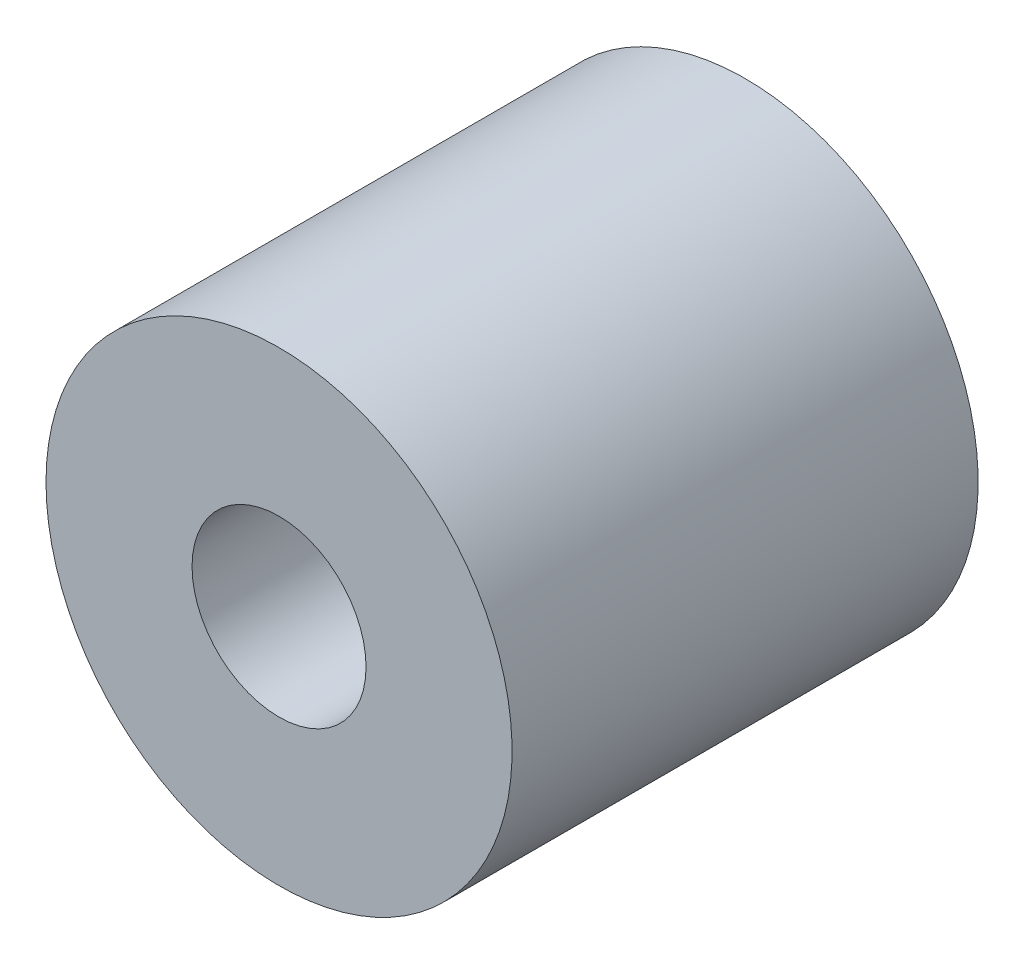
ISO-10303-21;
HEADER;
FILE_DESCRIPTION(('STEP AP214'),'2;1');
FILE_NAME('part.step','',(''),(''),'','','');
FILE_SCHEMA(('AUTOMOTIVE_DESIGN { 1 0 10303 214 1 1 1 1 }'));
ENDSEC;
DATA;
#1=APPLICATION_CONTEXT('core data for automotive mechanical design processes');
#2=APPLICATION_PROTOCOL_DEFINITION('international standard','automotive_design',2000,#1);
#3=PRODUCT_CONTEXT('',#1,'mechanical');
#4=PRODUCT('Part','Part','',(#3));
#5=PRODUCT_RELATED_PRODUCT_CATEGORY('part','',(#4));
#6=PRODUCT_DEFINITION_FORMATION('','',#4);
#7=PRODUCT_DEFINITION_CONTEXT('part definition',#1,'design');
#8=PRODUCT_DEFINITION('design','',#6,#7);
#9=PRODUCT_DEFINITION_SHAPE('','',#8);
#10=(LENGTH_UNIT() NAMED_UNIT(*) SI_UNIT(.MILLI.,.METRE.));
#11=(NAMED_UNIT(*) PLANE_ANGLE_UNIT() SI_UNIT($,.RADIAN.));
#12=(NAMED_UNIT(*) SI_UNIT($,.STERADIAN.) SOLID_ANGLE_UNIT());
#13=UNCERTAINTY_MEASURE_WITH_UNIT(LENGTH_MEASURE(1.E-05),#10,'distance_accuracy_value','');
#14=(GEOMETRIC_REPRESENTATION_CONTEXT(3) GLOBAL_UNCERTAINTY_ASSIGNED_CONTEXT((#13)) GLOBAL_UNIT_ASSIGNED_CONTEXT((#10,
#11,#12)) REPRESENTATION_CONTEXT('',''));
#15=CARTESIAN_POINT('',(0.,0.,0.));
#16=DIRECTION('',(0.,0.,1.));
#17=DIRECTION('',(1.,0.,0.));
#18=AXIS2_PLACEMENT_3D('',#15,#16,#17);
#19=CARTESIAN_POINT('',(0.,0.,4.7625));
#20=DIRECTION('',(0.,0.,1.));
#21=DIRECTION('',(1.,0.,0.));
#22=AXIS2_PLACEMENT_3D('',#19,#20,#21);
#23=PLANE('',#22);
#24=CARTESIAN_POINT('',(0.,0.,4.7625));
#25=DIRECTION('',(0.,0.,1.));
#26=DIRECTION('',(1.,0.,0.));
#27=AXIS2_PLACEMENT_3D('',#24,#25,#26);
#28=CIRCLE('',#27,4.7625);
#29=CARTESIAN_POINT('',(-4.7625,0.,4.7625));
#30=VERTEX_POINT('',#29);
#31=EDGE_CURVE('E10',#30,#30,#28,.T.);
#32=ORIENTED_EDGE('',*,*,#31,.T.);
#33=EDGE_LOOP('',(#32));
#34=FACE_BOUND('',#33,.T.);
#35=CARTESIAN_POINT('',(0.,0.,4.7625));
#36=DIRECTION('',(0.,0.,1.));
#37=DIRECTION('',(1.,0.,0.));
#38=AXIS2_PLACEMENT_3D('',#35,#36,#37);
#39=CIRCLE('',#38,1.778);
#40=CARTESIAN_POINT('',(-1.778,0.,4.7625));
#41=VERTEX_POINT('',#40);
#42=EDGE_CURVE('E43',#41,#41,#39,.T.);
#43=ORIENTED_EDGE('',*,*,#42,.F.);
#44=EDGE_LOOP('',(#43));
#45=FACE_BOUND('',#44,.T.);
#46=ADVANCED_FACE('F32',(#34,#45),#23,.T.);
#47=CARTESIAN_POINT('',(0.,0.,-4.7625));
#48=DIRECTION('',(0.,0.,1.));
#49=DIRECTION('',(1.,0.,0.));
#50=AXIS2_PLACEMENT_3D('',#47,#48,#49);
#51=PLANE('',#50);
#52=CARTESIAN_POINT('',(0.,0.,-4.7625));
#53=DIRECTION('',(0.,0.,1.));
#54=DIRECTION('',(1.,0.,0.));
#55=AXIS2_PLACEMENT_3D('',#52,#53,#54);
#56=CIRCLE('',#55,4.7625);
#57=CARTESIAN_POINT('',(-4.7625,0.,-4.7625));
#58=VERTEX_POINT('',#57);
#59=EDGE_CURVE('E36',#58,#58,#56,.T.);
#60=ORIENTED_EDGE('',*,*,#59,.F.);
#61=EDGE_LOOP('',(#60));
#62=FACE_BOUND('',#61,.T.);
#63=CARTESIAN_POINT('',(0.,0.,-4.7625));
#64=DIRECTION('',(0.,0.,1.));
#65=DIRECTION('',(1.,0.,0.));
#66=AXIS2_PLACEMENT_3D('',#63,#64,#65);
#67=CIRCLE('',#66,1.778);
#68=CARTESIAN_POINT('',(-1.778,0.,-4.7625));
#69=VERTEX_POINT('',#68);
#70=EDGE_CURVE('E45',#69,#69,#67,.T.);
#71=ORIENTED_EDGE('',*,*,#70,.T.);
#72=EDGE_LOOP('',(#71));
#73=FACE_BOUND('',#72,.T.);
#74=ADVANCED_FACE('F55',(#62,#73),#51,.F.);
#75=CARTESIAN_POINT('',(0.,0.,4.7625));
#76=DIRECTION('',(0.,0.,-1.));
#77=DIRECTION('',(-1.,0.,0.));
#78=AXIS2_PLACEMENT_3D('',#75,#76,#77);
#79=CYLINDRICAL_SURFACE('',#78,4.7625);
#80=CARTESIAN_POINT('',(-4.7625,0.,4.7625));
#81=CARTESIAN_POINT('',(-4.7625,0.,4.66328125));
#82=CARTESIAN_POINT('',(-4.7625,0.,4.5640625));
#83=CARTESIAN_POINT('',(-4.7625,0.,4.365625));
#84=CARTESIAN_POINT('',(-4.7625,0.,4.26640625));
#85=CARTESIAN_POINT('',(-4.7625,0.,4.06796875));
#86=CARTESIAN_POINT('',(-4.7625,0.,3.96875));
#87=CARTESIAN_POINT('',(-4.7625,0.,3.7703125));
#88=CARTESIAN_POINT('',(-4.7625,0.,3.67109375));
#89=CARTESIAN_POINT('',(-4.7625,0.,3.47265625));
#90=CARTESIAN_POINT('',(-4.7625,0.,3.3734375));
#91=CARTESIAN_POINT('',(-4.7625,0.,3.175));
#92=CARTESIAN_POINT('',(-4.7625,0.,3.07578125));
#93=CARTESIAN_POINT('',(-4.7625,0.,2.87734375));
#94=CARTESIAN_POINT('',(-4.7625,0.,2.778125));
#95=CARTESIAN_POINT('',(-4.7625,0.,2.5796875));
#96=CARTESIAN_POINT('',(-4.7625,0.,2.48046875));
#97=CARTESIAN_POINT('',(-4.7625,0.,2.28203125));
#98=CARTESIAN_POINT('',(-4.7625,0.,2.1828125));
#99=CARTESIAN_POINT('',(-4.7625,0.,1.984375));
#100=CARTESIAN_POINT('',(-4.7625,0.,1.88515625));
#101=CARTESIAN_POINT('',(-4.7625,0.,1.68671875));
#102=CARTESIAN_POINT('',(-4.7625,0.,1.5875));
#103=CARTESIAN_POINT('',(-4.7625,0.,1.3890625));
#104=CARTESIAN_POINT('',(-4.7625,0.,1.28984375));
#105=CARTESIAN_POINT('',(-4.7625,0.,1.09140625));
#106=CARTESIAN_POINT('',(-4.7625,0.,0.992187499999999));
#107=CARTESIAN_POINT('',(-4.7625,0.,0.79375));
#108=CARTESIAN_POINT('',(-4.7625,0.,0.69453125));
#109=CARTESIAN_POINT('',(-4.7625,0.,0.49609375));
#110=CARTESIAN_POINT('',(-4.7625,0.,0.396875));
#111=CARTESIAN_POINT('',(-4.7625,0.,0.1984375));
#112=CARTESIAN_POINT('',(-4.7625,0.,0.0992187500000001));
#113=CARTESIAN_POINT('',(-4.7625,0.,-0.0992187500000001));
#114=CARTESIAN_POINT('',(-4.7625,0.,-0.1984375));
#115=CARTESIAN_POINT('',(-4.7625,0.,-0.396875));
#116=CARTESIAN_POINT('',(-4.7625,0.,-0.49609375));
#117=CARTESIAN_POINT('',(-4.7625,0.,-0.69453125));
#118=CARTESIAN_POINT('',(-4.7625,0.,-0.793750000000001));
#119=CARTESIAN_POINT('',(-4.7625,0.,-0.992187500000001));
#120=CARTESIAN_POINT('',(-4.7625,0.,-1.09140625));
#121=CARTESIAN_POINT('',(-4.7625,0.,-1.28984375));
#122=CARTESIAN_POINT('',(-4.7625,0.,-1.3890625));
#123=CARTESIAN_POINT('',(-4.7625,0.,-1.5875));
#124=CARTESIAN_POINT('',(-4.7625,0.,-1.68671875));
#125=CARTESIAN_POINT('',(-4.7625,0.,-1.88515625));
#126=CARTESIAN_POINT('',(-4.7625,0.,-1.984375));
#127=CARTESIAN_POINT('',(-4.7625,0.,-2.1828125));
#128=CARTESIAN_POINT('',(-4.7625,0.,-2.28203125));
#129=CARTESIAN_POINT('',(-4.7625,0.,-2.48046875));
#130=CARTESIAN_POINT('',(-4.7625,0.,-2.5796875));
#131=CARTESIAN_POINT('',(-4.7625,0.,-2.778125));
#132=CARTESIAN_POINT('',(-4.7625,0.,-2.87734375));
#133=CARTESIAN_POINT('',(-4.7625,0.,-3.07578125));
#134=CARTESIAN_POINT('',(-4.7625,0.,-3.175));
#135=CARTESIAN_POINT('',(-4.7625,0.,-3.3734375));
#136=CARTESIAN_POINT('',(-4.7625,0.,-3.47265625));
#137=CARTESIAN_POINT('',(-4.7625,0.,-3.67109375));
#138=CARTESIAN_POINT('',(-4.7625,0.,-3.7703125));
#139=CARTESIAN_POINT('',(-4.7625,0.,-3.96875));
#140=CARTESIAN_POINT('',(-4.7625,0.,-4.06796875));
#141=CARTESIAN_POINT('',(-4.7625,0.,-4.26640625));
#142=CARTESIAN_POINT('',(-4.7625,0.,-4.365625));
#143=CARTESIAN_POINT('',(-4.7625,0.,-4.5640625));
#144=CARTESIAN_POINT('',(-4.7625,0.,-4.66328125));
#145=CARTESIAN_POINT('',(-4.7625,0.,-4.7625));
#146=B_SPLINE_CURVE_WITH_KNOTS('',3,(#80,#81,#82,#83,#84,#85,#86,#87,#88,#89,#90,#91,#92,#93,
#94,#95,#96,#97,#98,#99,#100,#101,#102,#103,#104,#105,#106,#107,#108,#109,#110,#111,#112,#113,
#114,#115,#116,#117,#118,#119,#120,#121,#122,#123,#124,#125,#126,#127,#128,#129,#130,#131,#132,
#133,#134,#135,#136,#137,#138,#139,#140,#141,#142,#143,#144,#145),.UNSPECIFIED.,.F.,.F.,(4,2,2,
2,2,2,2,2,2,2,2,2,2,2,2,2,2,2,2,2,2,2,2,2,2,2,2,2,2,2,2,2,4),(0.,0.29765625,0.5953125,
0.892968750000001,1.190625,1.48828125,1.7859375,2.08359375,2.38125,2.67890625,2.9765625,
3.27421875,3.571875,3.86953125,4.1671875,4.46484375,4.7625,5.06015625,5.3578125,5.65546875,
5.953125,6.25078125,6.5484375,6.84609375,7.14375,7.44140625,7.7390625,8.03671875,8.334375,
8.63203125,8.9296875,9.22734375,9.525),.UNSPECIFIED.);
#147=EDGE_CURVE('BSEAM34',#30,#58,#146,.T.);
#148=ORIENTED_EDGE('',*,*,#31,.F.);
#149=ORIENTED_EDGE('',*,*,#59,.T.);
#150=ORIENTED_EDGE('',*,*,#147,.T.);
#151=ORIENTED_EDGE('',*,*,#147,.F.);
#152=EDGE_LOOP('',(#148,#150,#149,#151));
#153=FACE_BOUND('',#152,.T.);
#154=ADVANCED_FACE('F34',(#153),#79,.T.);
#155=CARTESIAN_POINT('',(0.,0.,4.7625));
#156=DIRECTION('',(0.,0.,-1.));
#157=DIRECTION('',(-1.,0.,0.));
#158=AXIS2_PLACEMENT_3D('',#155,#156,#157);
#159=CYLINDRICAL_SURFACE('',#158,1.778);
#160=CARTESIAN_POINT('',(-1.778,0.,4.7625));
#161=CARTESIAN_POINT('',(-1.778,0.,4.66328125));
#162=CARTESIAN_POINT('',(-1.778,0.,4.5640625));
#163=CARTESIAN_POINT('',(-1.778,0.,4.365625));
#164=CARTESIAN_POINT('',(-1.778,0.,4.26640625));
#165=CARTESIAN_POINT('',(-1.778,0.,4.06796875));
#166=CARTESIAN_POINT('',(-1.778,0.,3.96875));
#167=CARTESIAN_POINT('',(-1.778,0.,3.7703125));
#168=CARTESIAN_POINT('',(-1.778,0.,3.67109375));
#169=CARTESIAN_POINT('',(-1.778,0.,3.47265625));
#170=CARTESIAN_POINT('',(-1.778,0.,3.3734375));
#171=CARTESIAN_POINT('',(-1.778,0.,3.175));
#172=CARTESIAN_POINT('',(-1.778,0.,3.07578125));
#173=CARTESIAN_POINT('',(-1.778,0.,2.87734375));
#174=CARTESIAN_POINT('',(-1.778,0.,2.778125));
#175=CARTESIAN_POINT('',(-1.778,0.,2.5796875));
#176=CARTESIAN_POINT('',(-1.778,0.,2.48046875));
#177=CARTESIAN_POINT('',(-1.778,0.,2.28203125));
#178=CARTESIAN_POINT('',(-1.778,0.,2.1828125));
#179=CARTESIAN_POINT('',(-1.778,0.,1.984375));
#180=CARTESIAN_POINT('',(-1.778,0.,1.88515625));
#181=CARTESIAN_POINT('',(-1.778,0.,1.68671875));
#182=CARTESIAN_POINT('',(-1.778,0.,1.5875));
#183=CARTESIAN_POINT('',(-1.778,0.,1.3890625));
#184=CARTESIAN_POINT('',(-1.778,0.,1.28984375));
#185=CARTESIAN_POINT('',(-1.778,0.,1.09140625));
#186=CARTESIAN_POINT('',(-1.778,0.,0.992187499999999));
#187=CARTESIAN_POINT('',(-1.778,0.,0.79375));
#188=CARTESIAN_POINT('',(-1.778,0.,0.69453125));
#189=CARTESIAN_POINT('',(-1.778,0.,0.49609375));
#190=CARTESIAN_POINT('',(-1.778,0.,0.396875));
#191=CARTESIAN_POINT('',(-1.778,0.,0.1984375));
#192=CARTESIAN_POINT('',(-1.778,0.,0.0992187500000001));
#193=CARTESIAN_POINT('',(-1.778,0.,-0.0992187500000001));
#194=CARTESIAN_POINT('',(-1.778,0.,-0.1984375));
#195=CARTESIAN_POINT('',(-1.778,0.,-0.396875));
#196=CARTESIAN_POINT('',(-1.778,0.,-0.49609375));
#197=CARTESIAN_POINT('',(-1.778,0.,-0.69453125));
#198=CARTESIAN_POINT('',(-1.778,0.,-0.793750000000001));
#199=CARTESIAN_POINT('',(-1.778,0.,-0.992187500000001));
#200=CARTESIAN_POINT('',(-1.778,0.,-1.09140625));
#201=CARTESIAN_POINT('',(-1.778,0.,-1.28984375));
#202=CARTESIAN_POINT('',(-1.778,0.,-1.3890625));
#203=CARTESIAN_POINT('',(-1.778,0.,-1.5875));
#204=CARTESIAN_POINT('',(-1.778,0.,-1.68671875));
#205=CARTESIAN_POINT('',(-1.778,0.,-1.88515625));
#206=CARTESIAN_POINT('',(-1.778,0.,-1.984375));
#207=CARTESIAN_POINT('',(-1.778,0.,-2.1828125));
#208=CARTESIAN_POINT('',(-1.778,0.,-2.28203125));
#209=CARTESIAN_POINT('',(-1.778,0.,-2.48046875));
#210=CARTESIAN_POINT('',(-1.778,0.,-2.5796875));
#211=CARTESIAN_POINT('',(-1.778,0.,-2.778125));
#212=CARTESIAN_POINT('',(-1.778,0.,-2.87734375));
#213=CARTESIAN_POINT('',(-1.778,0.,-3.07578125));
#214=CARTESIAN_POINT('',(-1.778,0.,-3.175));
#215=CARTESIAN_POINT('',(-1.778,0.,-3.3734375));
#216=CARTESIAN_POINT('',(-1.778,0.,-3.47265625));
#217=CARTESIAN_POINT('',(-1.778,0.,-3.67109375));
#218=CARTESIAN_POINT('',(-1.778,0.,-3.7703125));
#219=CARTESIAN_POINT('',(-1.778,0.,-3.96875));
#220=CARTESIAN_POINT('',(-1.778,0.,-4.06796875));
#221=CARTESIAN_POINT('',(-1.778,0.,-4.26640625));
#222=CARTESIAN_POINT('',(-1.778,0.,-4.365625));
#223=CARTESIAN_POINT('',(-1.778,0.,-4.5640625));
#224=CARTESIAN_POINT('',(-1.778,0.,-4.66328125));
#225=CARTESIAN_POINT('',(-1.778,0.,-4.7625));
#226=B_SPLINE_CURVE_WITH_KNOTS('',3,(#160,#161,#162,#163,#164,#165,#166,#167,#168,#169,#170,
#171,#172,#173,#174,#175,#176,#177,#178,#179,#180,#181,#182,#183,#184,#185,#186,#187,#188,#189,
#190,#191,#192,#193,#194,#195,#196,#197,#198,#199,#200,#201,#202,#203,#204,#205,#206,#207,#208,
#209,#210,#211,#212,#213,#214,#215,#216,#217,#218,#219,#220,#221,#222,#223,#224,#225),
.UNSPECIFIED.,.F.,.F.,(4,2,2,2,2,2,2,2,2,2,2,2,2,2,2,2,2,2,2,2,2,2,2,2,2,2,2,2,2,2,2,2,4),(0.,
0.29765625,0.5953125,0.892968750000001,1.190625,1.48828125,1.7859375,2.08359375,2.38125,
2.67890625,2.9765625,3.27421875,3.571875,3.86953125,4.1671875,4.46484375,4.7625,5.06015625,
5.3578125,5.65546875,5.953125,6.25078125,6.5484375,6.84609375,7.14375,7.44140625,7.7390625,
8.03671875,8.334375,8.63203125,8.9296875,9.22734375,9.525),.UNSPECIFIED.);
#227=EDGE_CURVE('BSEAM51',#41,#69,#226,.T.);
#228=ORIENTED_EDGE('',*,*,#42,.T.);
#229=ORIENTED_EDGE('',*,*,#70,.F.);
#230=ORIENTED_EDGE('',*,*,#227,.T.);
#231=ORIENTED_EDGE('',*,*,#227,.F.);
#232=EDGE_LOOP('',(#228,#230,#229,#231));
#233=FACE_BOUND('',#232,.T.);
#234=ADVANCED_FACE('F51',(#233),#159,.F.);
#235=CLOSED_SHELL('',(#46,#74,#154,#234));
#236=MANIFOLD_SOLID_BREP('B2',#235);
#237=ADVANCED_BREP_SHAPE_REPRESENTATION('',(#18,#236),#14);
#238=SHAPE_DEFINITION_REPRESENTATION(#9,#237);
ENDSEC;
END-ISO-10303-21;
